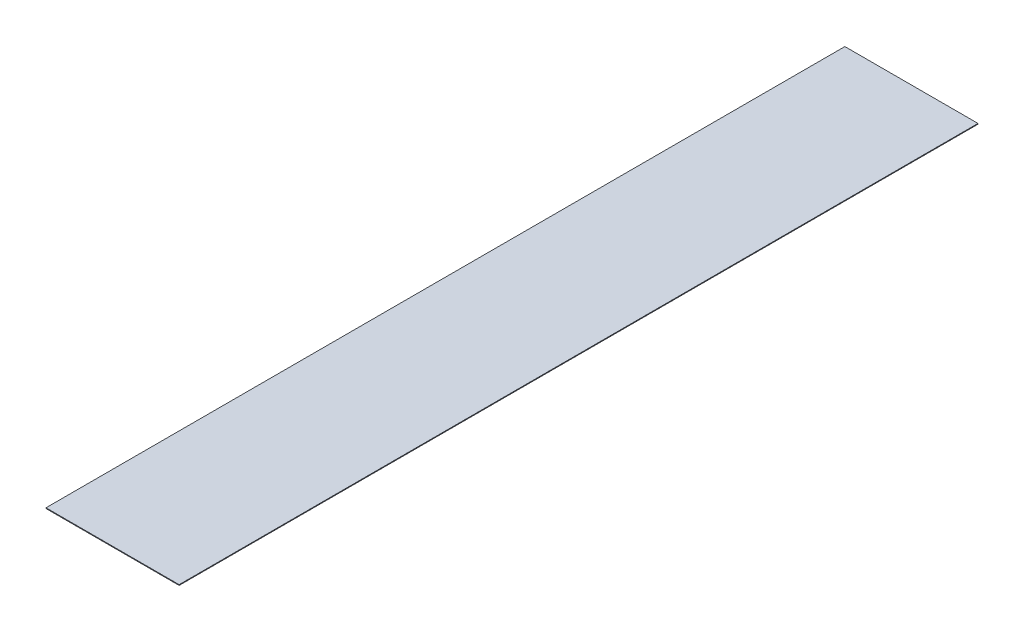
from build123d import *

# Parameters (mm, degrees)
ESQUISSE1_W      = 95
ESQUISSE1_H      = 570
EXTRUSION1_DEPTH = 0.5


with BuildPart() as part:
    # Esquisse1 → Extrusion1 (new body)
    with BuildSketch(Plane(origin=(0, 0, 0), x_dir=(1, 0, 0), z_dir=(0, 1, 0))):
        with Locations((47.5, 285)):
            Rectangle(ESQUISSE1_W, ESQUISSE1_H)
    extrude(amount=EXTRUSION1_DEPTH)


solid = part.part
